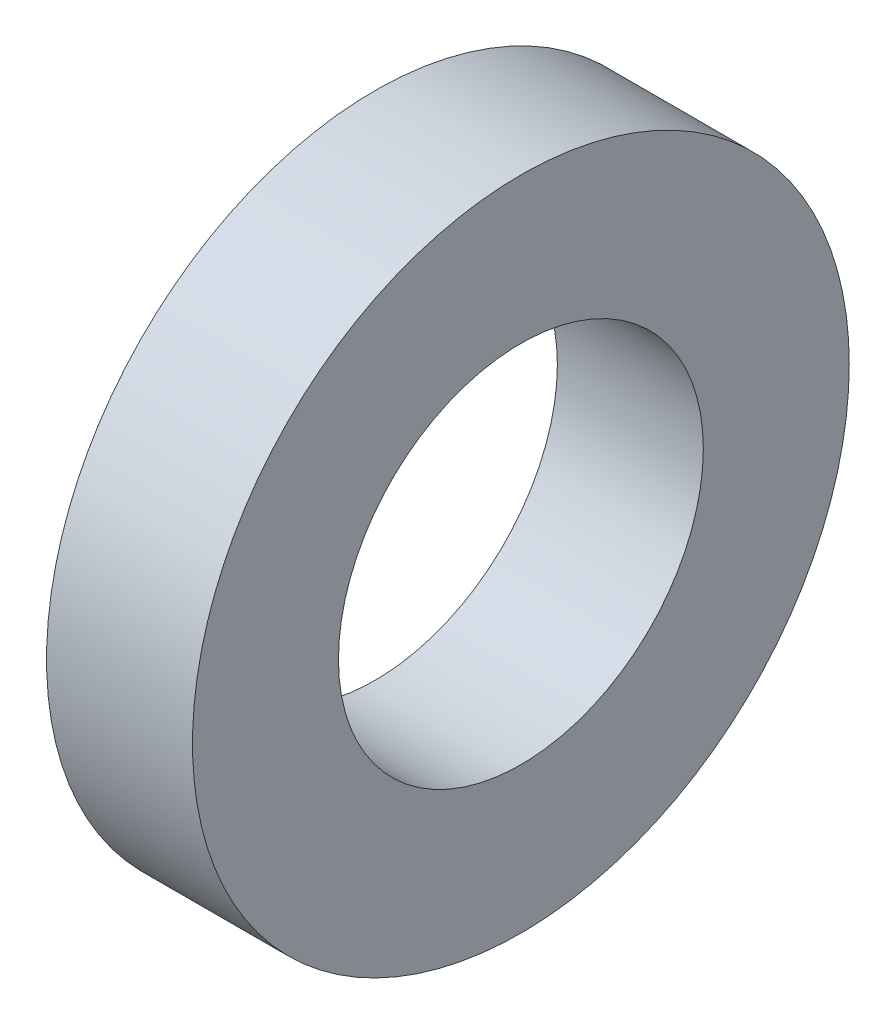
from build123d import *

# Parameters (mm, degrees)
ESQUISSE1_R          = 9
ESQUISSE1_R_2        = 5
BASE_EXTRUSION_DEPTH = 4


with BuildPart() as part:
    # Esquisse1 → Base-Extrusion (new body)
    with BuildSketch(Plane(origin=(0, 0, 0), x_dir=(0, 0, -1), z_dir=(1, 0, 0))):
        Circle(ESQUISSE1_R)
        Circle(ESQUISSE1_R_2, mode=Mode.SUBTRACT)
    extrude(amount=BASE_EXTRUSION_DEPTH)


solid = part.part
